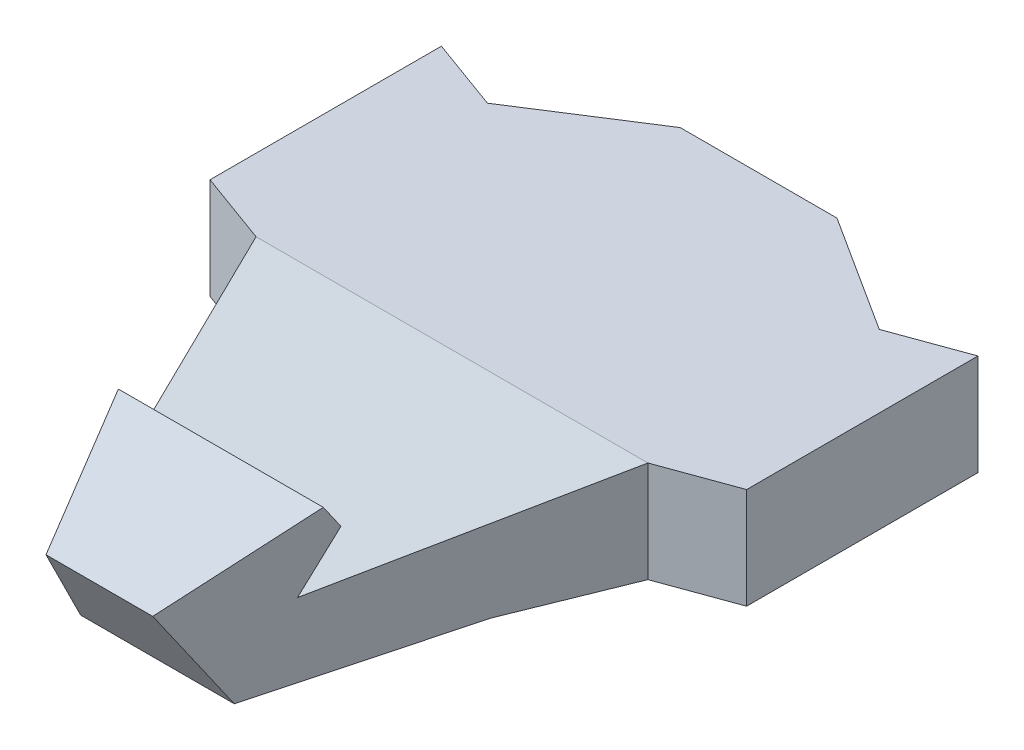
ISO-10303-21;
HEADER;
FILE_DESCRIPTION(('STEP AP214'),'2;1');
FILE_NAME('part.step','',(''),(''),'','','');
FILE_SCHEMA(('AUTOMOTIVE_DESIGN { 1 0 10303 214 1 1 1 1 }'));
ENDSEC;
DATA;
#1=APPLICATION_CONTEXT('core data for automotive mechanical design processes');
#2=APPLICATION_PROTOCOL_DEFINITION('international standard','automotive_design',2000,#1);
#3=PRODUCT_CONTEXT('',#1,'mechanical');
#4=PRODUCT('Part','Part','',(#3));
#5=PRODUCT_RELATED_PRODUCT_CATEGORY('part','',(#4));
#6=PRODUCT_DEFINITION_FORMATION('','',#4);
#7=PRODUCT_DEFINITION_CONTEXT('part definition',#1,'design');
#8=PRODUCT_DEFINITION('design','',#6,#7);
#9=PRODUCT_DEFINITION_SHAPE('','',#8);
#10=(LENGTH_UNIT() NAMED_UNIT(*) SI_UNIT(.MILLI.,.METRE.));
#11=(NAMED_UNIT(*) PLANE_ANGLE_UNIT() SI_UNIT($,.RADIAN.));
#12=(NAMED_UNIT(*) SI_UNIT($,.STERADIAN.) SOLID_ANGLE_UNIT());
#13=UNCERTAINTY_MEASURE_WITH_UNIT(LENGTH_MEASURE(1.E-05),#10,'distance_accuracy_value','');
#14=(GEOMETRIC_REPRESENTATION_CONTEXT(3) GLOBAL_UNCERTAINTY_ASSIGNED_CONTEXT((#13)) GLOBAL_UNIT_ASSIGNED_CONTEXT((#10,
#11,#12)) REPRESENTATION_CONTEXT('',''));
#15=CARTESIAN_POINT('',(0.,0.,0.));
#16=DIRECTION('',(0.,0.,1.));
#17=DIRECTION('',(1.,0.,0.));
#18=AXIS2_PLACEMENT_3D('',#15,#16,#17);
#19=CARTESIAN_POINT('',(123.896809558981,350.,-430.));
#20=DIRECTION('',(0.539124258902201,0.,0.84222623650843));
#21=DIRECTION('',(0.84222623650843,0.,-0.539124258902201));
#22=AXIS2_PLACEMENT_3D('',#19,#20,#21);
#23=PLANE('',#22);
#24=DIRECTION('',(0.,-1.,0.));
#25=VECTOR('',#24,1.);
#26=CARTESIAN_POINT('',(123.896809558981,350.,-430.));
#27=LINE('',#26,#25);
#28=CARTESIAN_POINT('',(123.896809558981,78.8346988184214,-430.));
#29=VERTEX_POINT('',#28);
#30=CARTESIAN_POINT('',(123.896809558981,12.9331394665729,-430.));
#31=VERTEX_POINT('',#30);
#32=EDGE_CURVE('E265',#29,#31,#27,.T.);
#33=ORIENTED_EDGE('',*,*,#32,.T.);
#34=DIRECTION('',(-0.84222623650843,0.,0.539124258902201));
#35=VECTOR('',#34,1.);
#36=CARTESIAN_POINT('',(123.896809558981,12.9331394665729,-430.));
#37=LINE('',#36,#35);
#38=CARTESIAN_POINT('',(47.2101814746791,12.9331394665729,-380.911501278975));
#39=VERTEX_POINT('',#38);
#40=EDGE_CURVE('E256',#31,#39,#37,.T.);
#41=ORIENTED_EDGE('',*,*,#40,.T.);
#42=DIRECTION('',(0.,-1.,0.));
#43=VECTOR('',#42,1.);
#44=CARTESIAN_POINT('',(47.2101814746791,350.,-380.911501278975));
#45=LINE('',#44,#43);
#46=CARTESIAN_POINT('',(47.2101814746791,78.8346988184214,-380.911501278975));
#47=VERTEX_POINT('',#46);
#48=EDGE_CURVE('E186',#47,#39,#45,.T.);
#49=ORIENTED_EDGE('',*,*,#48,.F.);
#50=DIRECTION('',(-0.84222623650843,0.,0.539124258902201));
#51=VECTOR('',#50,1.);
#52=CARTESIAN_POINT('',(123.896809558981,78.8346988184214,-430.));
#53=LINE('',#52,#51);
#54=EDGE_CURVE('E237',#29,#47,#53,.T.);
#55=ORIENTED_EDGE('',*,*,#54,.F.);
#56=EDGE_LOOP('',(#33,#41,#49,#55));
#57=FACE_BOUND('',#56,.T.);
#58=ADVANCED_FACE('F33',(#57),#23,.F.);
#59=CARTESIAN_POINT('',(47.2101814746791,350.,-380.911501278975));
#60=DIRECTION('',(-0.342020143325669,0.,0.939692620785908));
#61=DIRECTION('',(0.939692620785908,0.,0.342020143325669));
#62=AXIS2_PLACEMENT_3D('',#59,#60,#61);
#63=PLANE('',#62);
#64=ORIENTED_EDGE('',*,*,#48,.T.);
#65=DIRECTION('',(-0.939692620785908,0.,-0.342020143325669));
#66=VECTOR('',#65,1.);
#67=CARTESIAN_POINT('',(47.2101814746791,12.9331394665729,-380.911501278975));
#68=LINE('',#67,#66);
#69=CARTESIAN_POINT('',(0.,12.9331394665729,-398.094602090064));
#70=VERTEX_POINT('',#69);
#71=EDGE_CURVE('E253',#39,#70,#68,.T.);
#72=ORIENTED_EDGE('',*,*,#71,.T.);
#73=DIRECTION('',(0.,-1.,0.));
#74=VECTOR('',#73,1.);
#75=CARTESIAN_POINT('',(0.,350.,-398.094602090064));
#76=LINE('',#75,#74);
#77=CARTESIAN_POINT('',(0.,78.8346988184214,-398.094602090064));
#78=VERTEX_POINT('',#77);
#79=EDGE_CURVE('E183',#78,#70,#76,.T.);
#80=ORIENTED_EDGE('',*,*,#79,.F.);
#81=DIRECTION('',(-0.939692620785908,0.,-0.342020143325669));
#82=VECTOR('',#81,1.);
#83=CARTESIAN_POINT('',(47.2101814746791,78.8346988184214,-380.911501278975));
#84=LINE('',#83,#82);
#85=EDGE_CURVE('E235',#47,#78,#84,.T.);
#86=ORIENTED_EDGE('',*,*,#85,.F.);
#87=EDGE_LOOP('',(#64,#72,#80,#86));
#88=FACE_BOUND('',#87,.T.);
#89=ADVANCED_FACE('F323',(#88),#63,.F.);
#90=CARTESIAN_POINT('',(0.,350.,-398.094602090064));
#91=DIRECTION('',(1.,0.,0.));
#92=DIRECTION('',(0.,0.,-1.));
#93=AXIS2_PLACEMENT_3D('',#90,#91,#92);
#94=PLANE('',#93);
#95=ORIENTED_EDGE('',*,*,#79,.T.);
#96=DIRECTION('',(0.,0.,1.));
#97=VECTOR('',#96,1.);
#98=CARTESIAN_POINT('',(0.,12.9331394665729,-398.094602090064));
#99=LINE('',#98,#97);
#100=CARTESIAN_POINT('',(0.,12.9331394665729,-247.183100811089));
#101=VERTEX_POINT('',#100);
#102=EDGE_CURVE('E250',#70,#101,#99,.T.);
#103=ORIENTED_EDGE('',*,*,#102,.T.);
#104=DIRECTION('',(0.,-1.,0.));
#105=VECTOR('',#104,1.);
#106=CARTESIAN_POINT('',(0.,350.,-247.183100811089));
#107=LINE('',#106,#105);
#108=CARTESIAN_POINT('',(0.,78.8346988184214,-247.183100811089));
#109=VERTEX_POINT('',#108);
#110=EDGE_CURVE('E180',#109,#101,#107,.T.);
#111=ORIENTED_EDGE('',*,*,#110,.F.);
#112=DIRECTION('',(0.,0.,1.));
#113=VECTOR('',#112,1.);
#114=CARTESIAN_POINT('',(0.,78.8346988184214,-398.094602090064));
#115=LINE('',#114,#113);
#116=EDGE_CURVE('E229',#78,#109,#115,.T.);
#117=ORIENTED_EDGE('',*,*,#116,.F.);
#118=EDGE_LOOP('',(#95,#103,#111,#117));
#119=FACE_BOUND('',#118,.T.);
#120=ADVANCED_FACE('F318',(#119),#94,.F.);
#121=CARTESIAN_POINT('',(0.,350.,-247.183100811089));
#122=DIRECTION('',(0.342020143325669,0.,-0.939692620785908));
#123=DIRECTION('',(-0.939692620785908,0.,-0.342020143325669));
#124=AXIS2_PLACEMENT_3D('',#121,#122,#123);
#125=PLANE('',#124);
#126=ORIENTED_EDGE('',*,*,#110,.T.);
#127=DIRECTION('',(0.939692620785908,0.,0.342020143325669));
#128=VECTOR('',#127,1.);
#129=CARTESIAN_POINT('',(0.,12.9331394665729,-247.183100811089));
#130=LINE('',#129,#128);
#131=CARTESIAN_POINT('',(47.2101814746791,12.9331394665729,-230.));
#132=VERTEX_POINT('',#131);
#133=EDGE_CURVE('E247',#101,#132,#130,.T.);
#134=ORIENTED_EDGE('',*,*,#133,.T.);
#135=DIRECTION('',(0.,-1.,0.));
#136=VECTOR('',#135,1.);
#137=CARTESIAN_POINT('',(47.2101814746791,350.,-230.));
#138=LINE('',#137,#136);
#139=CARTESIAN_POINT('',(47.2101814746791,78.8346988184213,-230.));
#140=VERTEX_POINT('',#139);
#141=EDGE_CURVE('E172',#140,#132,#138,.T.);
#142=ORIENTED_EDGE('',*,*,#141,.F.);
#143=DIRECTION('',(0.939692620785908,0.,0.342020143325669));
#144=VECTOR('',#143,1.);
#145=CARTESIAN_POINT('',(0.,78.8346988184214,-247.183100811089));
#146=LINE('',#145,#144);
#147=EDGE_CURVE('E225',#109,#140,#146,.T.);
#148=ORIENTED_EDGE('',*,*,#147,.F.);
#149=EDGE_LOOP('',(#126,#134,#142,#148));
#150=FACE_BOUND('',#149,.T.);
#151=ADVANCED_FACE('F315',(#150),#125,.F.);
#152=CARTESIAN_POINT('',(47.2101814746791,350.,-230.));
#153=DIRECTION('',(0.927103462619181,0.,-0.374805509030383));
#154=DIRECTION('',(-0.374805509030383,0.,-0.927103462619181));
#155=AXIS2_PLACEMENT_3D('',#152,#153,#154);
#156=PLANE('',#155);
#157=ORIENTED_EDGE('',*,*,#141,.T.);
#158=DIRECTION('',(0.374805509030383,0.,0.927103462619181));
#159=VECTOR('',#158,1.);
#160=CARTESIAN_POINT('',(47.2101814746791,12.9331394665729,-230.));
#161=LINE('',#160,#159);
#162=CARTESIAN_POINT('',(76.5440043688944,12.9331394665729,-157.44106444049));
#163=VERTEX_POINT('',#162);
#164=EDGE_CURVE('E244',#132,#163,#161,.T.);
#165=ORIENTED_EDGE('',*,*,#164,.T.);
#166=DIRECTION('',(0.372934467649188,-0.0997955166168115,0.9224753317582));
#167=VECTOR('',#166,1.);
#168=CARTESIAN_POINT('',(34.9576406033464,24.0614556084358,-260.307380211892));
#169=LINE('',#168,#167);
#170=CARTESIAN_POINT('',(124.874967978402,0.,-37.8915844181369));
#171=VERTEX_POINT('',#170);
#172=EDGE_CURVE('E297',#163,#171,#169,.T.);
#173=ORIENTED_EDGE('',*,*,#172,.T.);
#174=DIRECTION('',(-0.209326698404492,-0.829508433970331,-0.517781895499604));
#175=VECTOR('',#174,1.);
#176=CARTESIAN_POINT('',(161.423488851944,144.832486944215,52.5133307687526));
#177=LINE('',#176,#175);
#178=CARTESIAN_POINT('',(140.193619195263,60.7039163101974,0.));
#179=VERTEX_POINT('',#178);
#180=EDGE_CURVE('E293',#179,#171,#177,.T.);
#181=ORIENTED_EDGE('',*,*,#180,.F.);
#182=DIRECTION('',(0.342493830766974,-0.406185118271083,0.847178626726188));
#183=VECTOR('',#182,1.);
#184=CARTESIAN_POINT('',(22.3054952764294,200.514906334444,-291.603205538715));
#185=LINE('',#184,#183);
#186=CARTESIAN_POINT('',(108.168296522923,98.6847740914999,-79.2165185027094));
#187=VERTEX_POINT('',#186);
#188=EDGE_CURVE('E263',#187,#179,#185,.T.);
#189=ORIENTED_EDGE('',*,*,#188,.F.);
#190=DIRECTION('',(0.209326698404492,0.829508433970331,0.517781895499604));
#191=VECTOR('',#190,1.);
#192=CARTESIAN_POINT('',(132.792438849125,196.263983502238,-18.3072547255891));
#193=LINE('',#192,#191);
#194=CARTESIAN_POINT('',(104.851596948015,85.541537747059,-87.4205699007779));
#195=VERTEX_POINT('',#194);
#196=EDGE_CURVE('E55',#195,#187,#193,.T.);
#197=ORIENTED_EDGE('',*,*,#196,.F.);
#198=DIRECTION('',(-0.201056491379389,0.84394554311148,-0.497325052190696));
#199=VECTOR('',#198,1.);
#200=CARTESIAN_POINT('',(43.3914335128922,343.523912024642,-239.445897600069));
#201=LINE('',#200,#199);
#202=CARTESIAN_POINT('',(113.009266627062,51.2992761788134,-67.242094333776));
#203=VERTEX_POINT('',#202);
#204=EDGE_CURVE('E210',#203,#195,#201,.T.);
#205=ORIENTED_EDGE('',*,*,#204,.F.);
#206=DIRECTION('',(0.370278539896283,-0.154953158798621,0.915905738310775));
#207=VECTOR('',#206,1.);
#208=CARTESIAN_POINT('',(31.6518474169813,85.3455082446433,-268.484454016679));
#209=LINE('',#208,#207);
#210=EDGE_CURVE('E259',#140,#203,#209,.T.);
#211=ORIENTED_EDGE('',*,*,#210,.F.);
#212=EDGE_LOOP('',(#157,#165,#173,#181,#189,#197,#205,#211));
#213=FACE_BOUND('',#212,.T.);
#214=ADVANCED_FACE('F301',(#213),#156,.F.);
#215=CARTESIAN_POINT('',(302.789818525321,350.,-230.));
#216=DIRECTION('',(-0.927103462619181,0.,-0.374805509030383));
#217=DIRECTION('',(-0.374805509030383,0.,0.927103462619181));
#218=AXIS2_PLACEMENT_3D('',#215,#216,#217);
#219=PLANE('',#218);
#220=DIRECTION('',(0.372934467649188,0.0997955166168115,-0.9224753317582));
#221=VECTOR('',#220,1.);
#222=CARTESIAN_POINT('',(315.042359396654,24.0614556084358,-260.307380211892));
#223=LINE('',#222,#221);
#224=CARTESIAN_POINT('',(225.125032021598,0.,-37.8915844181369));
#225=VERTEX_POINT('',#224);
#226=CARTESIAN_POINT('',(273.455995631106,12.9331394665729,-157.44106444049));
#227=VERTEX_POINT('',#226);
#228=EDGE_CURVE('E295',#225,#227,#223,.T.);
#229=ORIENTED_EDGE('',*,*,#228,.T.);
#230=DIRECTION('',(0.374805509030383,0.,-0.927103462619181));
#231=VECTOR('',#230,1.);
#232=CARTESIAN_POINT('',(302.789818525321,12.9331394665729,-230.));
#233=LINE('',#232,#231);
#234=CARTESIAN_POINT('',(302.789818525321,12.9331394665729,-230.));
#235=VERTEX_POINT('',#234);
#236=EDGE_CURVE('E166',#227,#235,#233,.T.);
#237=ORIENTED_EDGE('',*,*,#236,.T.);
#238=DIRECTION('',(0.,-1.,0.));
#239=VECTOR('',#238,1.);
#240=CARTESIAN_POINT('',(302.789818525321,350.,-230.));
#241=LINE('',#240,#239);
#242=CARTESIAN_POINT('',(302.789818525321,78.8346988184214,-230.));
#243=VERTEX_POINT('',#242);
#244=EDGE_CURVE('E165',#243,#235,#241,.T.);
#245=ORIENTED_EDGE('',*,*,#244,.F.);
#246=DIRECTION('',(0.370278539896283,0.154953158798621,-0.915905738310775));
#247=VECTOR('',#246,1.);
#248=CARTESIAN_POINT('',(318.348152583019,85.3455082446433,-268.484454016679));
#249=LINE('',#248,#247);
#250=CARTESIAN_POINT('',(236.990733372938,51.2992761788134,-67.2420943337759));
#251=VERTEX_POINT('',#250);
#252=EDGE_CURVE('E194',#251,#243,#249,.T.);
#253=ORIENTED_EDGE('',*,*,#252,.F.);
#254=DIRECTION('',(-0.201056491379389,-0.84394554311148,0.497325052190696));
#255=VECTOR('',#254,1.);
#256=CARTESIAN_POINT('',(306.608566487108,343.523912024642,-239.445897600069));
#257=LINE('',#256,#255);
#258=CARTESIAN_POINT('',(245.148403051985,85.541537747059,-87.4205699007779));
#259=VERTEX_POINT('',#258);
#260=EDGE_CURVE('E196',#259,#251,#257,.T.);
#261=ORIENTED_EDGE('',*,*,#260,.F.);
#262=DIRECTION('',(0.209326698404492,-0.829508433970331,-0.517781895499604));
#263=VECTOR('',#262,1.);
#264=CARTESIAN_POINT('',(217.207561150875,196.263983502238,-18.3072547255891));
#265=LINE('',#264,#263);
#266=CARTESIAN_POINT('',(241.831703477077,98.6847740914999,-79.2165185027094));
#267=VERTEX_POINT('',#266);
#268=EDGE_CURVE('E40',#267,#259,#265,.T.);
#269=ORIENTED_EDGE('',*,*,#268,.F.);
#270=DIRECTION('',(0.342493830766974,0.406185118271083,-0.847178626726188));
#271=VECTOR('',#270,1.);
#272=CARTESIAN_POINT('',(327.694504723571,200.514906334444,-291.603205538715));
#273=LINE('',#272,#271);
#274=CARTESIAN_POINT('',(209.806380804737,60.7039163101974,0.));
#275=VERTEX_POINT('',#274);
#276=EDGE_CURVE('E11',#275,#267,#273,.T.);
#277=ORIENTED_EDGE('',*,*,#276,.F.);
#278=DIRECTION('',(-0.209326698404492,0.829508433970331,0.517781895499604));
#279=VECTOR('',#278,1.);
#280=CARTESIAN_POINT('',(188.576511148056,144.832486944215,52.5133307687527));
#281=LINE('',#280,#279);
#282=EDGE_CURVE('E291',#225,#275,#281,.T.);
#283=ORIENTED_EDGE('',*,*,#282,.F.);
#284=EDGE_LOOP('',(#229,#237,#245,#253,#261,#269,#277,#283));
#285=FACE_BOUND('',#284,.T.);
#286=ADVANCED_FACE('F215',(#285),#219,.F.);
#287=CARTESIAN_POINT('',(350.,350.,-247.183100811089));
#288=DIRECTION('',(-0.34202014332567,0.,-0.939692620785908));
#289=DIRECTION('',(-0.939692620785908,0.,0.34202014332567));
#290=AXIS2_PLACEMENT_3D('',#287,#288,#289);
#291=PLANE('',#290);
#292=ORIENTED_EDGE('',*,*,#244,.T.);
#293=DIRECTION('',(0.939692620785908,0.,-0.34202014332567));
#294=VECTOR('',#293,1.);
#295=CARTESIAN_POINT('',(350.,12.9331394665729,-247.183100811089));
#296=LINE('',#295,#294);
#297=CARTESIAN_POINT('',(350.,12.9331394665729,-247.183100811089));
#298=VERTEX_POINT('',#297);
#299=EDGE_CURVE('E148',#235,#298,#296,.T.);
#300=ORIENTED_EDGE('',*,*,#299,.T.);
#301=DIRECTION('',(0.,-1.,0.));
#302=VECTOR('',#301,1.);
#303=CARTESIAN_POINT('',(350.,350.,-247.183100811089));
#304=LINE('',#303,#302);
#305=CARTESIAN_POINT('',(350.,78.8346988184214,-247.183100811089));
#306=VERTEX_POINT('',#305);
#307=EDGE_CURVE('E163',#306,#298,#304,.T.);
#308=ORIENTED_EDGE('',*,*,#307,.F.);
#309=DIRECTION('',(0.939692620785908,0.,-0.34202014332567));
#310=VECTOR('',#309,1.);
#311=CARTESIAN_POINT('',(350.,78.8346988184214,-247.183100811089));
#312=LINE('',#311,#310);
#313=EDGE_CURVE('E223',#243,#306,#312,.T.);
#314=ORIENTED_EDGE('',*,*,#313,.F.);
#315=EDGE_LOOP('',(#292,#300,#308,#314));
#316=FACE_BOUND('',#315,.T.);
#317=ADVANCED_FACE('F161',(#316),#291,.F.);
#318=CARTESIAN_POINT('',(350.,350.,-398.094602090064));
#319=DIRECTION('',(-1.,0.,0.));
#320=DIRECTION('',(0.,0.,1.));
#321=AXIS2_PLACEMENT_3D('',#318,#319,#320);
#322=PLANE('',#321);
#323=ORIENTED_EDGE('',*,*,#307,.T.);
#324=DIRECTION('',(0.,0.,-1.));
#325=VECTOR('',#324,1.);
#326=CARTESIAN_POINT('',(350.,12.9331394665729,0.));
#327=LINE('',#326,#325);
#328=CARTESIAN_POINT('',(350.,12.9331394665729,-398.094602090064));
#329=VERTEX_POINT('',#328);
#330=EDGE_CURVE('E145',#298,#329,#327,.T.);
#331=ORIENTED_EDGE('',*,*,#330,.T.);
#332=DIRECTION('',(0.,-1.,0.));
#333=VECTOR('',#332,1.);
#334=CARTESIAN_POINT('',(350.,350.,-398.094602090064));
#335=LINE('',#334,#333);
#336=CARTESIAN_POINT('',(350.,78.8346988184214,-398.094602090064));
#337=VERTEX_POINT('',#336);
#338=EDGE_CURVE('E170',#337,#329,#335,.T.);
#339=ORIENTED_EDGE('',*,*,#338,.F.);
#340=DIRECTION('',(0.,0.,-1.));
#341=VECTOR('',#340,1.);
#342=CARTESIAN_POINT('',(350.,78.8346988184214,0.));
#343=LINE('',#342,#341);
#344=EDGE_CURVE('E156',#306,#337,#343,.T.);
#345=ORIENTED_EDGE('',*,*,#344,.F.);
#346=EDGE_LOOP('',(#323,#331,#339,#345));
#347=FACE_BOUND('',#346,.T.);
#348=ADVANCED_FACE('F169',(#347),#322,.F.);
#349=CARTESIAN_POINT('',(302.789818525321,350.,-380.911501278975));
#350=DIRECTION('',(0.342020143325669,0.,0.939692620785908));
#351=DIRECTION('',(0.939692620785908,0.,-0.342020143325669));
#352=AXIS2_PLACEMENT_3D('',#349,#350,#351);
#353=PLANE('',#352);
#354=ORIENTED_EDGE('',*,*,#338,.T.);
#355=DIRECTION('',(-0.939692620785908,0.,0.342020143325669));
#356=VECTOR('',#355,1.);
#357=CARTESIAN_POINT('',(302.789818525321,12.9331394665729,-380.911501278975));
#358=LINE('',#357,#356);
#359=CARTESIAN_POINT('',(302.789818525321,12.9331394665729,-380.911501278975));
#360=VERTEX_POINT('',#359);
#361=EDGE_CURVE('E151',#329,#360,#358,.T.);
#362=ORIENTED_EDGE('',*,*,#361,.T.);
#363=DIRECTION('',(0.,-1.,0.));
#364=VECTOR('',#363,1.);
#365=CARTESIAN_POINT('',(302.789818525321,350.,-380.911501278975));
#366=LINE('',#365,#364);
#367=CARTESIAN_POINT('',(302.789818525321,78.8346988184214,-380.911501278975));
#368=VERTEX_POINT('',#367);
#369=EDGE_CURVE('E174',#368,#360,#366,.T.);
#370=ORIENTED_EDGE('',*,*,#369,.F.);
#371=DIRECTION('',(-0.939692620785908,0.,0.342020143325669));
#372=VECTOR('',#371,1.);
#373=CARTESIAN_POINT('',(302.789818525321,78.8346988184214,-380.911501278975));
#374=LINE('',#373,#372);
#375=EDGE_CURVE('E227',#337,#368,#374,.T.);
#376=ORIENTED_EDGE('',*,*,#375,.F.);
#377=EDGE_LOOP('',(#354,#362,#370,#376));
#378=FACE_BOUND('',#377,.T.);
#379=ADVANCED_FACE('F277',(#378),#353,.F.);
#380=CARTESIAN_POINT('',(226.103190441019,350.,-430.));
#381=DIRECTION('',(-0.539124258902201,0.,0.84222623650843));
#382=DIRECTION('',(0.84222623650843,0.,0.539124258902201));
#383=AXIS2_PLACEMENT_3D('',#380,#381,#382);
#384=PLANE('',#383);
#385=ORIENTED_EDGE('',*,*,#369,.T.);
#386=DIRECTION('',(-0.84222623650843,0.,-0.539124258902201));
#387=VECTOR('',#386,1.);
#388=CARTESIAN_POINT('',(226.103190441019,12.9331394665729,-430.));
#389=LINE('',#388,#387);
#390=CARTESIAN_POINT('',(226.103190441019,12.9331394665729,-430.));
#391=VERTEX_POINT('',#390);
#392=EDGE_CURVE('E239',#360,#391,#389,.T.);
#393=ORIENTED_EDGE('',*,*,#392,.T.);
#394=DIRECTION('',(0.,-1.,0.));
#395=VECTOR('',#394,1.);
#396=CARTESIAN_POINT('',(226.103190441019,350.,-430.));
#397=LINE('',#396,#395);
#398=CARTESIAN_POINT('',(226.103190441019,78.8346988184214,-430.));
#399=VERTEX_POINT('',#398);
#400=EDGE_CURVE('E268',#399,#391,#397,.T.);
#401=ORIENTED_EDGE('',*,*,#400,.F.);
#402=DIRECTION('',(-0.84222623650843,0.,-0.539124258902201));
#403=VECTOR('',#402,1.);
#404=CARTESIAN_POINT('',(226.103190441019,78.8346988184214,-430.));
#405=LINE('',#404,#403);
#406=EDGE_CURVE('E47',#368,#399,#405,.T.);
#407=ORIENTED_EDGE('',*,*,#406,.F.);
#408=EDGE_LOOP('',(#385,#393,#401,#407));
#409=FACE_BOUND('',#408,.T.);
#410=ADVANCED_FACE('F273',(#409),#384,.F.);
#411=CARTESIAN_POINT('',(226.103190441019,350.,-430.));
#412=DIRECTION('',(0.,0.,1.));
#413=DIRECTION('',(1.,0.,0.));
#414=AXIS2_PLACEMENT_3D('',#411,#412,#413);
#415=PLANE('',#414);
#416=ORIENTED_EDGE('',*,*,#400,.T.);
#417=DIRECTION('',(-1.,0.,0.));
#418=VECTOR('',#417,1.);
#419=CARTESIAN_POINT('',(226.103190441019,12.9331394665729,-430.));
#420=LINE('',#419,#418);
#421=EDGE_CURVE('E191',#391,#31,#420,.T.);
#422=ORIENTED_EDGE('',*,*,#421,.T.);
#423=ORIENTED_EDGE('',*,*,#32,.F.);
#424=DIRECTION('',(-1.,0.,0.));
#425=VECTOR('',#424,1.);
#426=CARTESIAN_POINT('',(226.103190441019,78.8346988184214,-430.));
#427=LINE('',#426,#425);
#428=EDGE_CURVE('E189',#399,#29,#427,.T.);
#429=ORIENTED_EDGE('',*,*,#428,.F.);
#430=EDGE_LOOP('',(#416,#422,#423,#429));
#431=FACE_BOUND('',#430,.T.);
#432=ADVANCED_FACE('F329',(#431),#415,.F.);
#433=CARTESIAN_POINT('',(350.,49.3576598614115,23.664840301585));
#434=DIRECTION('',(0.,0.901714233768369,0.432332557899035));
#435=DIRECTION('',(0.,-0.432332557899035,0.901714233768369));
#436=AXIS2_PLACEMENT_3D('',#433,#434,#435);
#437=PLANE('',#436);
#438=ORIENTED_EDGE('',*,*,#188,.T.);
#439=DIRECTION('',(-1.,0.,0.));
#440=VECTOR('',#439,1.);
#441=CARTESIAN_POINT('',(350.,60.7039163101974,0.));
#442=LINE('',#441,#440);
#443=EDGE_CURVE('E282',#275,#179,#442,.T.);
#444=ORIENTED_EDGE('',*,*,#443,.F.);
#445=ORIENTED_EDGE('',*,*,#276,.T.);
#446=DIRECTION('',(-1.,0.,0.));
#447=VECTOR('',#446,1.);
#448=CARTESIAN_POINT('',(350.,98.6847740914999,-79.2165185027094));
#449=LINE('',#448,#447);
#450=EDGE_CURVE('E201',#267,#187,#449,.T.);
#451=ORIENTED_EDGE('',*,*,#450,.T.);
#452=EDGE_LOOP('',(#438,#444,#445,#451));
#453=FACE_BOUND('',#452,.T.);
#454=ADVANCED_FACE('F312',(#453),#437,.T.);
#455=CARTESIAN_POINT('',(350.,63.2526293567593,-101.33337990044));
#456=DIRECTION('',(0.,0.529512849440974,-0.848301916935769));
#457=DIRECTION('',(0.,0.848301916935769,0.529512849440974));
#458=AXIS2_PLACEMENT_3D('',#455,#456,#457);
#459=PLANE('',#458);
#460=ORIENTED_EDGE('',*,*,#196,.T.);
#461=ORIENTED_EDGE('',*,*,#450,.F.);
#462=ORIENTED_EDGE('',*,*,#268,.T.);
#463=DIRECTION('',(-1.,0.,0.));
#464=VECTOR('',#463,1.);
#465=CARTESIAN_POINT('',(350.,85.541537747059,-87.4205699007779));
#466=LINE('',#465,#464);
#467=EDGE_CURVE('E200',#259,#195,#466,.T.);
#468=ORIENTED_EDGE('',*,*,#467,.T.);
#469=EDGE_LOOP('',(#460,#461,#462,#468));
#470=FACE_BOUND('',#469,.T.);
#471=ADVANCED_FACE('F199',(#470),#459,.T.);
#472=CARTESIAN_POINT('',(350.,-16.1889890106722,-27.4722237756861));
#473=DIRECTION('',(0.,-0.507692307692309,-0.861538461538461));
#474=DIRECTION('',(0.,0.861538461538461,-0.507692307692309));
#475=AXIS2_PLACEMENT_3D('',#472,#473,#474);
#476=PLANE('',#475);
#477=ORIENTED_EDGE('',*,*,#204,.T.);
#478=ORIENTED_EDGE('',*,*,#467,.F.);
#479=ORIENTED_EDGE('',*,*,#260,.T.);
#480=DIRECTION('',(-1.,0.,0.));
#481=VECTOR('',#480,1.);
#482=CARTESIAN_POINT('',(350.,51.2992761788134,-67.242094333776));
#483=LINE('',#482,#481);
#484=EDGE_CURVE('E211',#251,#203,#483,.T.);
#485=ORIENTED_EDGE('',*,*,#484,.T.);
#486=EDGE_LOOP('',(#477,#478,#479,#485));
#487=FACE_BOUND('',#486,.T.);
#488=ADVANCED_FACE('F206',(#487),#476,.T.);
#489=CARTESIAN_POINT('',(350.,38.8123565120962,6.56628405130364));
#490=DIRECTION('',(0.,0.985989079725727,0.166809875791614));
#491=DIRECTION('',(0.,-0.166809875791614,0.985989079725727));
#492=AXIS2_PLACEMENT_3D('',#489,#490,#491);
#493=PLANE('',#492);
#494=ORIENTED_EDGE('',*,*,#210,.T.);
#495=ORIENTED_EDGE('',*,*,#484,.F.);
#496=ORIENTED_EDGE('',*,*,#252,.T.);
#497=DIRECTION('',(-1.,0.,0.));
#498=VECTOR('',#497,1.);
#499=CARTESIAN_POINT('',(350.,78.8346988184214,-230.));
#500=LINE('',#499,#498);
#501=EDGE_CURVE('E220',#243,#140,#500,.T.);
#502=ORIENTED_EDGE('',*,*,#501,.T.);
#503=EDGE_LOOP('',(#494,#495,#496,#502));
#504=FACE_BOUND('',#503,.T.);
#505=ADVANCED_FACE('F219',(#504),#493,.T.);
#506=CARTESIAN_POINT('',(350.,12.9331394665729,0.));
#507=DIRECTION('',(0.,1.,0.));
#508=DIRECTION('',(0.,0.,1.));
#509=AXIS2_PLACEMENT_3D('',#506,#507,#508);
#510=PLANE('',#509);
#511=ORIENTED_EDGE('',*,*,#421,.F.);
#512=ORIENTED_EDGE('',*,*,#392,.F.);
#513=ORIENTED_EDGE('',*,*,#361,.F.);
#514=ORIENTED_EDGE('',*,*,#330,.F.);
#515=ORIENTED_EDGE('',*,*,#299,.F.);
#516=ORIENTED_EDGE('',*,*,#236,.F.);
#517=DIRECTION('',(-1.,0.,0.));
#518=VECTOR('',#517,1.);
#519=CARTESIAN_POINT('',(350.,12.933139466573,-157.44106444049));
#520=LINE('',#519,#518);
#521=EDGE_CURVE('E288',#227,#163,#520,.T.);
#522=ORIENTED_EDGE('',*,*,#521,.T.);
#523=ORIENTED_EDGE('',*,*,#164,.F.);
#524=ORIENTED_EDGE('',*,*,#133,.F.);
#525=ORIENTED_EDGE('',*,*,#102,.F.);
#526=ORIENTED_EDGE('',*,*,#71,.F.);
#527=ORIENTED_EDGE('',*,*,#40,.F.);
#528=EDGE_LOOP('',(#511,#512,#513,#514,#515,#516,#522,#523,#524,#525,#526,#527));
#529=FACE_BOUND('',#528,.T.);
#530=ADVANCED_FACE('F147',(#529),#510,.F.);
#531=CARTESIAN_POINT('',(350.,78.8346988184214,0.));
#532=DIRECTION('',(0.,1.,0.));
#533=DIRECTION('',(0.,0.,1.));
#534=AXIS2_PLACEMENT_3D('',#531,#532,#533);
#535=PLANE('',#534);
#536=ORIENTED_EDGE('',*,*,#54,.T.);
#537=ORIENTED_EDGE('',*,*,#85,.T.);
#538=ORIENTED_EDGE('',*,*,#116,.T.);
#539=ORIENTED_EDGE('',*,*,#147,.T.);
#540=ORIENTED_EDGE('',*,*,#501,.F.);
#541=ORIENTED_EDGE('',*,*,#313,.T.);
#542=ORIENTED_EDGE('',*,*,#344,.T.);
#543=ORIENTED_EDGE('',*,*,#375,.T.);
#544=ORIENTED_EDGE('',*,*,#406,.T.);
#545=ORIENTED_EDGE('',*,*,#428,.T.);
#546=EDGE_LOOP('',(#536,#537,#538,#539,#540,#541,#542,#543,#544,#545));
#547=FACE_BOUND('',#546,.T.);
#548=ADVANCED_FACE('F222',(#547),#535,.T.);
#549=CARTESIAN_POINT('',(350.,-4.05177965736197,-0.438330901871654));
#550=DIRECTION('',(0.,0.994199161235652,0.107554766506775));
#551=DIRECTION('',(0.,-0.107554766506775,0.994199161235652));
#552=AXIS2_PLACEMENT_3D('',#549,#550,#551);
#553=PLANE('',#552);
#554=ORIENTED_EDGE('',*,*,#521,.F.);
#555=ORIENTED_EDGE('',*,*,#228,.F.);
#556=DIRECTION('',(-1.,0.,0.));
#557=VECTOR('',#556,1.);
#558=CARTESIAN_POINT('',(350.,0.,-37.8915844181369));
#559=LINE('',#558,#557);
#560=EDGE_CURVE('E285',#225,#171,#559,.T.);
#561=ORIENTED_EDGE('',*,*,#560,.T.);
#562=ORIENTED_EDGE('',*,*,#172,.F.);
#563=EDGE_LOOP('',(#554,#555,#561,#562));
#564=FACE_BOUND('',#563,.T.);
#565=ADVANCED_FACE('F305',(#564),#553,.F.);
#566=CARTESIAN_POINT('',(350.,17.0203982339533,-27.2673958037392));
#567=DIRECTION('',(0.,-0.529512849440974,0.848301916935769));
#568=DIRECTION('',(0.,-0.848301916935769,-0.529512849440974));
#569=AXIS2_PLACEMENT_3D('',#566,#567,#568);
#570=PLANE('',#569);
#571=ORIENTED_EDGE('',*,*,#180,.T.);
#572=ORIENTED_EDGE('',*,*,#560,.F.);
#573=ORIENTED_EDGE('',*,*,#282,.T.);
#574=ORIENTED_EDGE('',*,*,#443,.T.);
#575=EDGE_LOOP('',(#571,#572,#573,#574));
#576=FACE_BOUND('',#575,.T.);
#577=ADVANCED_FACE('F309',(#576),#570,.T.);
#578=CLOSED_SHELL('',(#58,#89,#120,#151,#214,#286,#317,#348,#379,#410,#432,#454,#471,#488,#505,
#530,#548,#565,#577));
#579=MANIFOLD_SOLID_BREP('B2',#578);
#580=ADVANCED_BREP_SHAPE_REPRESENTATION('',(#18,#579),#14);
#581=SHAPE_DEFINITION_REPRESENTATION(#9,#580);
ENDSEC;
END-ISO-10303-21;
